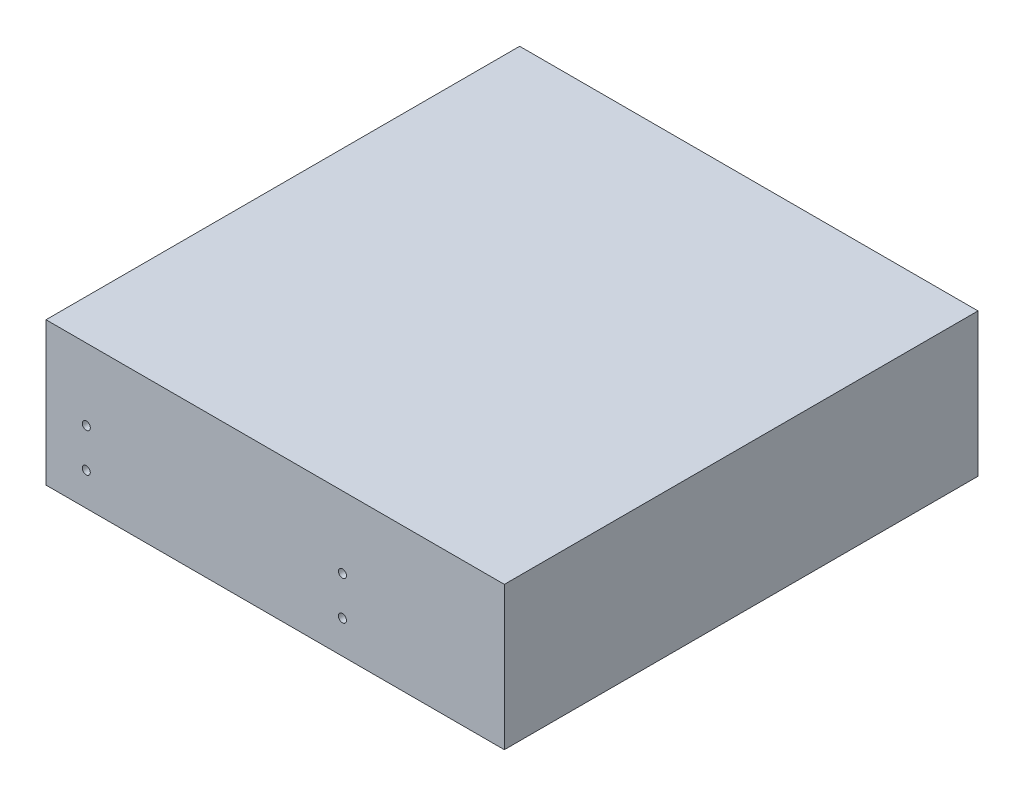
from build123d import *

# Parameters (mm, degrees)
SKETCH1_W           = 142.25
SKETCH1_H           = 44.45
SKETCH1_R           = 1.25
BOSS_EXTRUDE1_DEPTH = 147


with BuildPart() as part:
    # Sketch1 → Boss-Extrude1 (new body)
    with BuildSketch(Plane.XY):
        with Locations((-20.875, -0.025)):
            Rectangle(SKETCH1_W, SKETCH1_H)
        Circle(SKETCH1_R, mode=Mode.SUBTRACT)
        with Locations((-79.5, 0)):
            Circle(SKETCH1_R, mode=Mode.SUBTRACT)
        with Locations((0, -12)):
            Circle(SKETCH1_R, mode=Mode.SUBTRACT)
        with Locations((-79.5, -12)):
            Circle(SKETCH1_R, mode=Mode.SUBTRACT)
    extrude(amount=BOSS_EXTRUDE1_DEPTH)


solid = part.part
